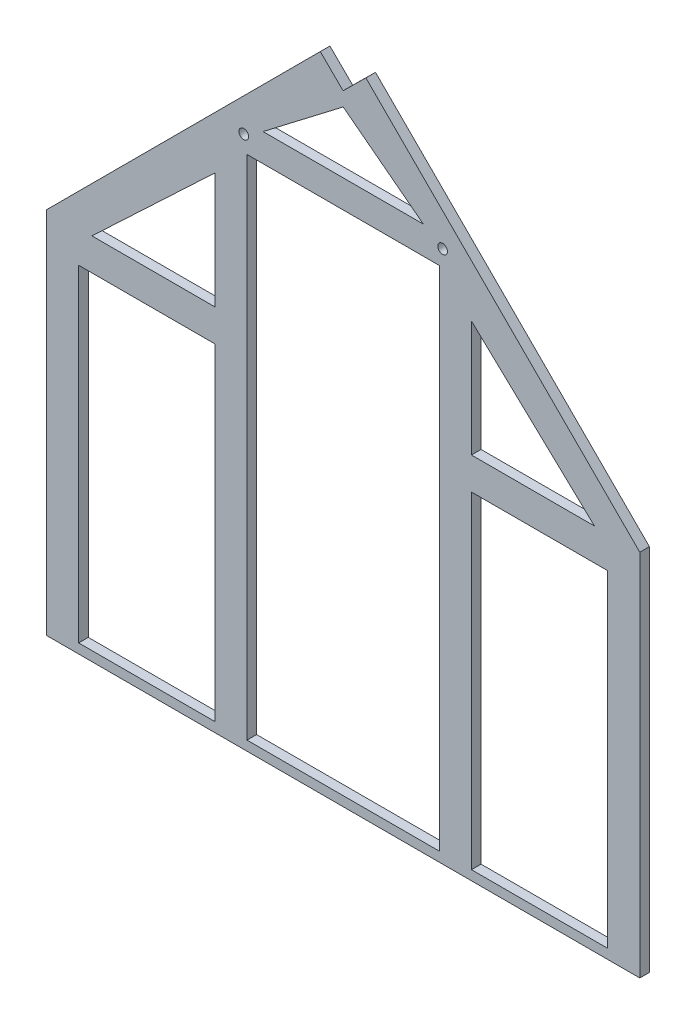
ISO-10303-21;
HEADER;
FILE_DESCRIPTION(('STEP AP214'),'2;1');
FILE_NAME('part.step','',(''),(''),'','','');
FILE_SCHEMA(('AUTOMOTIVE_DESIGN { 1 0 10303 214 1 1 1 1 }'));
ENDSEC;
DATA;
#1=APPLICATION_CONTEXT('core data for automotive mechanical design processes');
#2=APPLICATION_PROTOCOL_DEFINITION('international standard','automotive_design',2000,#1);
#3=PRODUCT_CONTEXT('',#1,'mechanical');
#4=PRODUCT('Part','Part','',(#3));
#5=PRODUCT_RELATED_PRODUCT_CATEGORY('part','',(#4));
#6=PRODUCT_DEFINITION_FORMATION('','',#4);
#7=PRODUCT_DEFINITION_CONTEXT('part definition',#1,'design');
#8=PRODUCT_DEFINITION('design','',#6,#7);
#9=PRODUCT_DEFINITION_SHAPE('','',#8);
#10=(LENGTH_UNIT() NAMED_UNIT(*) SI_UNIT(.MILLI.,.METRE.));
#11=(NAMED_UNIT(*) PLANE_ANGLE_UNIT() SI_UNIT($,.RADIAN.));
#12=(NAMED_UNIT(*) SI_UNIT($,.STERADIAN.) SOLID_ANGLE_UNIT());
#13=UNCERTAINTY_MEASURE_WITH_UNIT(LENGTH_MEASURE(1.E-05),#10,'distance_accuracy_value','');
#14=(GEOMETRIC_REPRESENTATION_CONTEXT(3) GLOBAL_UNCERTAINTY_ASSIGNED_CONTEXT((#13)) GLOBAL_UNIT_ASSIGNED_CONTEXT((#10,
#11,#12)) REPRESENTATION_CONTEXT('',''));
#15=CARTESIAN_POINT('',(0.,0.,0.));
#16=DIRECTION('',(0.,0.,1.));
#17=DIRECTION('',(1.,0.,0.));
#18=AXIS2_PLACEMENT_3D('',#15,#16,#17);
#19=CARTESIAN_POINT('',(0.,0.,3.));
#20=DIRECTION('',(0.,0.,-1.));
#21=DIRECTION('',(-1.,0.,0.));
#22=AXIS2_PLACEMENT_3D('',#19,#20,#21);
#23=PLANE('',#22);
#24=CARTESIAN_POINT('',(61.5,166.178932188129,3.));
#25=DIRECTION('',(0.,0.,1.));
#26=DIRECTION('',(1.,0.,0.));
#27=AXIS2_PLACEMENT_3D('',#24,#25,#26);
#28=CIRCLE('',#27,1.5);
#29=CARTESIAN_POINT('',(63.,166.178932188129,3.));
#30=VERTEX_POINT('',#29);
#31=EDGE_CURVE('E228',#30,#30,#28,.T.);
#32=ORIENTED_EDGE('',*,*,#31,.F.);
#33=EDGE_LOOP('',(#32));
#34=FACE_BOUND('',#33,.T.);
#35=DIRECTION('',(-1.,0.,0.));
#36=VECTOR('',#35,1.);
#37=CARTESIAN_POINT('',(175.,105.,3.));
#38=LINE('',#37,#36);
#39=CARTESIAN_POINT('',(175.,105.,3.));
#40=VERTEX_POINT('',#39);
#41=CARTESIAN_POINT('',(132.5,105.,3.));
#42=VERTEX_POINT('',#41);
#43=EDGE_CURVE('E255',#40,#42,#38,.T.);
#44=ORIENTED_EDGE('',*,*,#43,.F.);
#45=DIRECTION('',(0.,1.,0.));
#46=VECTOR('',#45,1.);
#47=CARTESIAN_POINT('',(175.,105.,3.));
#48=LINE('',#47,#46);
#49=CARTESIAN_POINT('',(175.,3.,3.));
#50=VERTEX_POINT('',#49);
#51=EDGE_CURVE('E262',#50,#40,#48,.T.);
#52=ORIENTED_EDGE('',*,*,#51,.F.);
#53=DIRECTION('',(1.,0.,0.));
#54=VECTOR('',#53,1.);
#55=CARTESIAN_POINT('',(175.,3.,3.));
#56=LINE('',#55,#54);
#57=CARTESIAN_POINT('',(132.5,2.99999999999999,3.));
#58=VERTEX_POINT('',#57);
#59=EDGE_CURVE('E259',#58,#50,#56,.T.);
#60=ORIENTED_EDGE('',*,*,#59,.F.);
#61=DIRECTION('',(0.,-1.,0.));
#62=VECTOR('',#61,1.);
#63=CARTESIAN_POINT('',(132.5,105.,3.));
#64=LINE('',#63,#62);
#65=EDGE_CURVE('E257',#42,#58,#64,.T.);
#66=ORIENTED_EDGE('',*,*,#65,.F.);
#67=EDGE_LOOP('',(#44,#52,#60,#66));
#68=FACE_BOUND('',#67,.T.);
#69=DIRECTION('',(-1.,0.,0.));
#70=VECTOR('',#69,1.);
#71=CARTESIAN_POINT('',(10.,105.,3.));
#72=LINE('',#71,#70);
#73=CARTESIAN_POINT('',(52.5,105.,3.));
#74=VERTEX_POINT('',#73);
#75=CARTESIAN_POINT('',(10.,105.,3.));
#76=VERTEX_POINT('',#75);
#77=EDGE_CURVE('E310',#74,#76,#72,.T.);
#78=ORIENTED_EDGE('',*,*,#77,.F.);
#79=DIRECTION('',(0.,1.,0.));
#80=VECTOR('',#79,1.);
#81=CARTESIAN_POINT('',(52.5,105.,3.));
#82=LINE('',#81,#80);
#83=CARTESIAN_POINT('',(52.5,2.99999999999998,3.));
#84=VERTEX_POINT('',#83);
#85=EDGE_CURVE('E317',#84,#74,#82,.T.);
#86=ORIENTED_EDGE('',*,*,#85,.F.);
#87=DIRECTION('',(1.,0.,0.));
#88=VECTOR('',#87,1.);
#89=CARTESIAN_POINT('',(10.,3.,3.));
#90=LINE('',#89,#88);
#91=CARTESIAN_POINT('',(10.,3.,3.));
#92=VERTEX_POINT('',#91);
#93=EDGE_CURVE('E314',#92,#84,#90,.T.);
#94=ORIENTED_EDGE('',*,*,#93,.F.);
#95=DIRECTION('',(0.,-1.,0.));
#96=VECTOR('',#95,1.);
#97=CARTESIAN_POINT('',(10.,105.,3.));
#98=LINE('',#97,#96);
#99=EDGE_CURVE('E312',#76,#92,#98,.T.);
#100=ORIENTED_EDGE('',*,*,#99,.F.);
#101=EDGE_LOOP('',(#78,#86,#94,#100));
#102=FACE_BOUND('',#101,.T.);
#103=DIRECTION('',(0.,-1.,0.));
#104=VECTOR('',#103,1.);
#105=CARTESIAN_POINT('',(62.5,2.99999999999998,3.));
#106=LINE('',#105,#104);
#107=CARTESIAN_POINT('',(62.5,161.178932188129,3.));
#108=VERTEX_POINT('',#107);
#109=CARTESIAN_POINT('',(62.5,2.99999999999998,3.));
#110=VERTEX_POINT('',#109);
#111=EDGE_CURVE('E365',#108,#110,#106,.T.);
#112=ORIENTED_EDGE('',*,*,#111,.F.);
#113=DIRECTION('',(-1.,0.,0.));
#114=VECTOR('',#113,1.);
#115=CARTESIAN_POINT('',(62.5,161.178932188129,3.));
#116=LINE('',#115,#114);
#117=CARTESIAN_POINT('',(122.5,161.178932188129,3.));
#118=VERTEX_POINT('',#117);
#119=EDGE_CURVE('E372',#118,#108,#116,.T.);
#120=ORIENTED_EDGE('',*,*,#119,.F.);
#121=DIRECTION('',(0.,1.,0.));
#122=VECTOR('',#121,1.);
#123=CARTESIAN_POINT('',(122.5,2.99999999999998,3.));
#124=LINE('',#123,#122);
#125=CARTESIAN_POINT('',(122.5,2.99999999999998,3.));
#126=VERTEX_POINT('',#125);
#127=EDGE_CURVE('E369',#126,#118,#124,.T.);
#128=ORIENTED_EDGE('',*,*,#127,.F.);
#129=DIRECTION('',(1.,0.,0.));
#130=VECTOR('',#129,1.);
#131=CARTESIAN_POINT('',(62.5,2.99999999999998,3.));
#132=LINE('',#131,#130);
#133=EDGE_CURVE('E367',#110,#126,#132,.T.);
#134=ORIENTED_EDGE('',*,*,#133,.F.);
#135=EDGE_LOOP('',(#112,#120,#128,#134));
#136=FACE_BOUND('',#135,.T.);
#137=DIRECTION('',(1.,0.,0.));
#138=VECTOR('',#137,1.);
#139=CARTESIAN_POINT('',(185.,0.,3.));
#140=LINE('',#139,#138);
#141=CARTESIAN_POINT('',(0.,0.,3.));
#142=VERTEX_POINT('',#141);
#143=CARTESIAN_POINT('',(185.,0.,3.));
#144=VERTEX_POINT('',#143);
#145=EDGE_CURVE('E399',#142,#144,#140,.T.);
#146=ORIENTED_EDGE('',*,*,#145,.T.);
#147=DIRECTION('',(0.,1.,0.));
#148=VECTOR('',#147,1.);
#149=CARTESIAN_POINT('',(185.,115.,3.));
#150=LINE('',#149,#148);
#151=CARTESIAN_POINT('',(185.,115.,3.));
#152=VERTEX_POINT('',#151);
#153=EDGE_CURVE('E402',#144,#152,#150,.T.);
#154=ORIENTED_EDGE('',*,*,#153,.T.);
#155=DIRECTION('',(-0.707247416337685,0.706966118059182,0.));
#156=VECTOR('',#155,1.);
#157=CARTESIAN_POINT('',(99.5710678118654,200.394953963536,3.));
#158=LINE('',#157,#156);
#159=CARTESIAN_POINT('',(99.5710678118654,200.394953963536,3.));
#160=VERTEX_POINT('',#159);
#161=EDGE_CURVE('E404',#152,#160,#158,.T.);
#162=ORIENTED_EDGE('',*,*,#161,.T.);
#163=DIRECTION('',(-0.710503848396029,-0.703693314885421,0.));
#164=VECTOR('',#163,1.);
#165=CARTESIAN_POINT('',(99.5710678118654,200.394953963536,3.));
#166=LINE('',#165,#164);
#167=CARTESIAN_POINT('',(92.465945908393,193.357938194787,3.));
#168=VERTEX_POINT('',#167);
#169=EDGE_CURVE('E406',#160,#168,#166,.T.);
#170=ORIENTED_EDGE('',*,*,#169,.T.);
#171=DIRECTION('',(-0.710495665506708,0.703701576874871,0.));
#172=VECTOR('',#171,1.);
#173=CARTESIAN_POINT('',(85.3609892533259,200.394953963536,3.));
#174=LINE('',#173,#172);
#175=CARTESIAN_POINT('',(85.3609892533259,200.394953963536,3.));
#176=VERTEX_POINT('',#175);
#177=EDGE_CURVE('E408',#168,#176,#174,.T.);
#178=ORIENTED_EDGE('',*,*,#177,.T.);
#179=DIRECTION('',(-0.706966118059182,-0.707247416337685,0.));
#180=VECTOR('',#179,1.);
#181=CARTESIAN_POINT('',(0.,115.,3.));
#182=LINE('',#181,#180);
#183=CARTESIAN_POINT('',(0.,115.,3.));
#184=VERTEX_POINT('',#183);
#185=EDGE_CURVE('E410',#176,#184,#182,.T.);
#186=ORIENTED_EDGE('',*,*,#185,.T.);
#187=DIRECTION('',(0.,-1.,0.));
#188=VECTOR('',#187,1.);
#189=CARTESIAN_POINT('',(0.,0.,3.));
#190=LINE('',#189,#188);
#191=EDGE_CURVE('E412',#184,#142,#190,.T.);
#192=ORIENTED_EDGE('',*,*,#191,.T.);
#193=EDGE_LOOP('',(#146,#154,#162,#170,#178,#186,#192));
#194=FACE_BOUND('',#193,.T.);
#195=DIRECTION('',(0.,1.,0.));
#196=VECTOR('',#195,1.);
#197=CARTESIAN_POINT('',(52.5000000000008,151.178932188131,3.));
#198=LINE('',#197,#196);
#199=CARTESIAN_POINT('',(52.5000000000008,115.,3.));
#200=VERTEX_POINT('',#199);
#201=CARTESIAN_POINT('',(52.5000000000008,151.178932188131,3.));
#202=VERTEX_POINT('',#201);
#203=EDGE_CURVE('E338',#200,#202,#198,.T.);
#204=ORIENTED_EDGE('',*,*,#203,.F.);
#205=DIRECTION('',(1.,0.,0.));
#206=VECTOR('',#205,1.);
#207=CARTESIAN_POINT('',(14.1421356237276,115.,3.));
#208=LINE('',#207,#206);
#209=CARTESIAN_POINT('',(14.1421356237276,115.,3.));
#210=VERTEX_POINT('',#209);
#211=EDGE_CURVE('E343',#210,#200,#208,.T.);
#212=ORIENTED_EDGE('',*,*,#211,.F.);
#213=DIRECTION('',(-0.727466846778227,-0.686142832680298,0.));
#214=VECTOR('',#213,1.);
#215=CARTESIAN_POINT('',(52.5000000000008,151.178932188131,3.));
#216=LINE('',#215,#214);
#217=EDGE_CURVE('E340',#202,#210,#216,.T.);
#218=ORIENTED_EDGE('',*,*,#217,.F.);
#219=EDGE_LOOP('',(#204,#212,#218));
#220=FACE_BOUND('',#219,.T.);
#221=DIRECTION('',(-0.727466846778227,0.686142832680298,0.));
#222=VECTOR('',#221,1.);
#223=CARTESIAN_POINT('',(132.499999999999,151.178932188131,3.));
#224=LINE('',#223,#222);
#225=CARTESIAN_POINT('',(170.857864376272,115.,3.));
#226=VERTEX_POINT('',#225);
#227=CARTESIAN_POINT('',(132.499999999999,151.178932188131,3.));
#228=VERTEX_POINT('',#227);
#229=EDGE_CURVE('E283',#226,#228,#224,.T.);
#230=ORIENTED_EDGE('',*,*,#229,.F.);
#231=DIRECTION('',(1.,0.,0.));
#232=VECTOR('',#231,1.);
#233=CARTESIAN_POINT('',(170.857864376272,115.,3.));
#234=LINE('',#233,#232);
#235=CARTESIAN_POINT('',(132.499999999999,115.,3.));
#236=VERTEX_POINT('',#235);
#237=EDGE_CURVE('E288',#236,#226,#234,.T.);
#238=ORIENTED_EDGE('',*,*,#237,.F.);
#239=DIRECTION('',(0.,-1.,0.));
#240=VECTOR('',#239,1.);
#241=CARTESIAN_POINT('',(132.499999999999,151.178932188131,3.));
#242=LINE('',#241,#240);
#243=EDGE_CURVE('E285',#228,#236,#242,.T.);
#244=ORIENTED_EDGE('',*,*,#243,.F.);
#245=EDGE_LOOP('',(#230,#238,#244));
#246=FACE_BOUND('',#245,.T.);
#247=DIRECTION('',(-0.793982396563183,0.607940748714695,0.));
#248=VECTOR('',#247,1.);
#249=CARTESIAN_POINT('',(117.5,169.857864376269,3.));
#250=LINE('',#249,#248);
#251=CARTESIAN_POINT('',(117.5,169.857864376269,3.));
#252=VERTEX_POINT('',#251);
#253=CARTESIAN_POINT('',(92.5,189.,3.));
#254=VERTEX_POINT('',#253);
#255=EDGE_CURVE('E223',#252,#254,#250,.T.);
#256=ORIENTED_EDGE('',*,*,#255,.F.);
#257=DIRECTION('',(1.,0.,0.));
#258=VECTOR('',#257,1.);
#259=CARTESIAN_POINT('',(67.5,169.857864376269,3.));
#260=LINE('',#259,#258);
#261=CARTESIAN_POINT('',(67.5,169.857864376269,3.));
#262=VERTEX_POINT('',#261);
#263=EDGE_CURVE('E239',#262,#252,#260,.T.);
#264=ORIENTED_EDGE('',*,*,#263,.F.);
#265=DIRECTION('',(-0.793982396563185,-0.607940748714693,0.));
#266=VECTOR('',#265,1.);
#267=CARTESIAN_POINT('',(92.5,189.,3.));
#268=LINE('',#267,#266);
#269=EDGE_CURVE('E237',#254,#262,#268,.T.);
#270=ORIENTED_EDGE('',*,*,#269,.F.);
#271=EDGE_LOOP('',(#256,#264,#270));
#272=FACE_BOUND('',#271,.T.);
#273=CARTESIAN_POINT('',(123.5,166.178932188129,3.));
#274=DIRECTION('',(0.,0.,1.));
#275=DIRECTION('',(-1.,0.,0.));
#276=AXIS2_PLACEMENT_3D('',#273,#274,#275);
#277=CIRCLE('',#276,1.5);
#278=CARTESIAN_POINT('',(122.,166.178932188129,3.));
#279=VERTEX_POINT('',#278);
#280=EDGE_CURVE('E575',#279,#279,#277,.T.);
#281=ORIENTED_EDGE('',*,*,#280,.F.);
#282=EDGE_LOOP('',(#281));
#283=FACE_BOUND('',#282,.T.);
#284=ADVANCED_FACE('F26',(#34,#68,#102,#136,#194,#220,#246,#272,#283),#23,.F.);
#285=CARTESIAN_POINT('',(0.,0.,0.));
#286=DIRECTION('',(0.,0.,-1.));
#287=DIRECTION('',(-1.,0.,0.));
#288=AXIS2_PLACEMENT_3D('',#285,#286,#287);
#289=PLANE('',#288);
#290=CARTESIAN_POINT('',(61.5,166.178932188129,0.));
#291=DIRECTION('',(0.,0.,1.));
#292=DIRECTION('',(1.,0.,0.));
#293=AXIS2_PLACEMENT_3D('',#290,#291,#292);
#294=CIRCLE('',#293,1.5);
#295=CARTESIAN_POINT('',(63.,166.178932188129,0.));
#296=VERTEX_POINT('',#295);
#297=EDGE_CURVE('E231',#296,#296,#294,.T.);
#298=ORIENTED_EDGE('',*,*,#297,.T.);
#299=EDGE_LOOP('',(#298));
#300=FACE_BOUND('',#299,.T.);
#301=DIRECTION('',(0.,1.,0.));
#302=VECTOR('',#301,1.);
#303=CARTESIAN_POINT('',(175.,105.,0.));
#304=LINE('',#303,#302);
#305=CARTESIAN_POINT('',(175.,3.,0.));
#306=VERTEX_POINT('',#305);
#307=CARTESIAN_POINT('',(175.,105.,0.));
#308=VERTEX_POINT('',#307);
#309=EDGE_CURVE('E252',#306,#308,#304,.T.);
#310=ORIENTED_EDGE('',*,*,#309,.T.);
#311=DIRECTION('',(-1.,0.,0.));
#312=VECTOR('',#311,1.);
#313=CARTESIAN_POINT('',(175.,105.,0.));
#314=LINE('',#313,#312);
#315=CARTESIAN_POINT('',(132.5,105.,0.));
#316=VERTEX_POINT('',#315);
#317=EDGE_CURVE('E224',#308,#316,#314,.T.);
#318=ORIENTED_EDGE('',*,*,#317,.T.);
#319=DIRECTION('',(0.,-1.,0.));
#320=VECTOR('',#319,1.);
#321=CARTESIAN_POINT('',(132.5,105.,0.));
#322=LINE('',#321,#320);
#323=CARTESIAN_POINT('',(132.5,2.99999999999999,0.));
#324=VERTEX_POINT('',#323);
#325=EDGE_CURVE('E246',#316,#324,#322,.T.);
#326=ORIENTED_EDGE('',*,*,#325,.T.);
#327=DIRECTION('',(1.,0.,0.));
#328=VECTOR('',#327,1.);
#329=CARTESIAN_POINT('',(175.,3.,0.));
#330=LINE('',#329,#328);
#331=EDGE_CURVE('E249',#324,#306,#330,.T.);
#332=ORIENTED_EDGE('',*,*,#331,.T.);
#333=EDGE_LOOP('',(#310,#318,#326,#332));
#334=FACE_BOUND('',#333,.T.);
#335=DIRECTION('',(0.,1.,0.));
#336=VECTOR('',#335,1.);
#337=CARTESIAN_POINT('',(52.5,105.,0.));
#338=LINE('',#337,#336);
#339=CARTESIAN_POINT('',(52.5,2.99999999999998,0.));
#340=VERTEX_POINT('',#339);
#341=CARTESIAN_POINT('',(52.5,105.,0.));
#342=VERTEX_POINT('',#341);
#343=EDGE_CURVE('E307',#340,#342,#338,.T.);
#344=ORIENTED_EDGE('',*,*,#343,.T.);
#345=DIRECTION('',(-1.,0.,0.));
#346=VECTOR('',#345,1.);
#347=CARTESIAN_POINT('',(10.,105.,0.));
#348=LINE('',#347,#346);
#349=CARTESIAN_POINT('',(10.,105.,0.));
#350=VERTEX_POINT('',#349);
#351=EDGE_CURVE('E298',#342,#350,#348,.T.);
#352=ORIENTED_EDGE('',*,*,#351,.T.);
#353=DIRECTION('',(0.,-1.,0.));
#354=VECTOR('',#353,1.);
#355=CARTESIAN_POINT('',(10.,105.,0.));
#356=LINE('',#355,#354);
#357=CARTESIAN_POINT('',(10.,3.,0.));
#358=VERTEX_POINT('',#357);
#359=EDGE_CURVE('E301',#350,#358,#356,.T.);
#360=ORIENTED_EDGE('',*,*,#359,.T.);
#361=DIRECTION('',(1.,0.,0.));
#362=VECTOR('',#361,1.);
#363=CARTESIAN_POINT('',(10.,3.,0.));
#364=LINE('',#363,#362);
#365=EDGE_CURVE('E304',#358,#340,#364,.T.);
#366=ORIENTED_EDGE('',*,*,#365,.T.);
#367=EDGE_LOOP('',(#344,#352,#360,#366));
#368=FACE_BOUND('',#367,.T.);
#369=DIRECTION('',(-1.,0.,0.));
#370=VECTOR('',#369,1.);
#371=CARTESIAN_POINT('',(62.5,161.178932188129,0.));
#372=LINE('',#371,#370);
#373=CARTESIAN_POINT('',(122.5,161.178932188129,0.));
#374=VERTEX_POINT('',#373);
#375=CARTESIAN_POINT('',(62.5,161.178932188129,0.));
#376=VERTEX_POINT('',#375);
#377=EDGE_CURVE('E362',#374,#376,#372,.T.);
#378=ORIENTED_EDGE('',*,*,#377,.T.);
#379=DIRECTION('',(0.,-1.,0.));
#380=VECTOR('',#379,1.);
#381=CARTESIAN_POINT('',(62.5,2.99999999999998,0.));
#382=LINE('',#381,#380);
#383=CARTESIAN_POINT('',(62.5,2.99999999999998,0.));
#384=VERTEX_POINT('',#383);
#385=EDGE_CURVE('E353',#376,#384,#382,.T.);
#386=ORIENTED_EDGE('',*,*,#385,.T.);
#387=DIRECTION('',(1.,0.,0.));
#388=VECTOR('',#387,1.);
#389=CARTESIAN_POINT('',(62.5,2.99999999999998,0.));
#390=LINE('',#389,#388);
#391=CARTESIAN_POINT('',(122.5,2.99999999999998,0.));
#392=VERTEX_POINT('',#391);
#393=EDGE_CURVE('E356',#384,#392,#390,.T.);
#394=ORIENTED_EDGE('',*,*,#393,.T.);
#395=DIRECTION('',(0.,1.,0.));
#396=VECTOR('',#395,1.);
#397=CARTESIAN_POINT('',(122.5,2.99999999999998,0.));
#398=LINE('',#397,#396);
#399=EDGE_CURVE('E359',#392,#374,#398,.T.);
#400=ORIENTED_EDGE('',*,*,#399,.T.);
#401=EDGE_LOOP('',(#378,#386,#394,#400));
#402=FACE_BOUND('',#401,.T.);
#403=DIRECTION('',(1.,0.,0.));
#404=VECTOR('',#403,1.);
#405=CARTESIAN_POINT('',(185.,0.,0.));
#406=LINE('',#405,#404);
#407=CARTESIAN_POINT('',(0.,0.,0.));
#408=VERTEX_POINT('',#407);
#409=CARTESIAN_POINT('',(185.,0.,0.));
#410=VERTEX_POINT('',#409);
#411=EDGE_CURVE('E384',#408,#410,#406,.T.);
#412=ORIENTED_EDGE('',*,*,#411,.F.);
#413=DIRECTION('',(0.,-1.,0.));
#414=VECTOR('',#413,1.);
#415=CARTESIAN_POINT('',(0.,0.,0.));
#416=LINE('',#415,#414);
#417=CARTESIAN_POINT('',(0.,115.,0.));
#418=VERTEX_POINT('',#417);
#419=EDGE_CURVE('E397',#418,#408,#416,.T.);
#420=ORIENTED_EDGE('',*,*,#419,.F.);
#421=DIRECTION('',(-0.706966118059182,-0.707247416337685,0.));
#422=VECTOR('',#421,1.);
#423=CARTESIAN_POINT('',(0.,115.,0.));
#424=LINE('',#423,#422);
#425=CARTESIAN_POINT('',(85.3609892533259,200.394953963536,0.));
#426=VERTEX_POINT('',#425);
#427=EDGE_CURVE('E395',#426,#418,#424,.T.);
#428=ORIENTED_EDGE('',*,*,#427,.F.);
#429=DIRECTION('',(-0.710495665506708,0.703701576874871,0.));
#430=VECTOR('',#429,1.);
#431=CARTESIAN_POINT('',(85.3609892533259,200.394953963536,0.));
#432=LINE('',#431,#430);
#433=CARTESIAN_POINT('',(92.465945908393,193.357938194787,0.));
#434=VERTEX_POINT('',#433);
#435=EDGE_CURVE('E393',#434,#426,#432,.T.);
#436=ORIENTED_EDGE('',*,*,#435,.F.);
#437=DIRECTION('',(-0.710503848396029,-0.703693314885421,0.));
#438=VECTOR('',#437,1.);
#439=CARTESIAN_POINT('',(99.5710678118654,200.394953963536,0.));
#440=LINE('',#439,#438);
#441=CARTESIAN_POINT('',(99.5710678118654,200.394953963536,0.));
#442=VERTEX_POINT('',#441);
#443=EDGE_CURVE('E391',#442,#434,#440,.T.);
#444=ORIENTED_EDGE('',*,*,#443,.F.);
#445=DIRECTION('',(-0.707247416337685,0.706966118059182,0.));
#446=VECTOR('',#445,1.);
#447=CARTESIAN_POINT('',(99.5710678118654,200.394953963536,0.));
#448=LINE('',#447,#446);
#449=CARTESIAN_POINT('',(185.,115.,0.));
#450=VERTEX_POINT('',#449);
#451=EDGE_CURVE('E389',#450,#442,#448,.T.);
#452=ORIENTED_EDGE('',*,*,#451,.F.);
#453=DIRECTION('',(0.,1.,0.));
#454=VECTOR('',#453,1.);
#455=CARTESIAN_POINT('',(185.,115.,0.));
#456=LINE('',#455,#454);
#457=EDGE_CURVE('E387',#410,#450,#456,.T.);
#458=ORIENTED_EDGE('',*,*,#457,.F.);
#459=EDGE_LOOP('',(#412,#420,#428,#436,#444,#452,#458));
#460=FACE_BOUND('',#459,.T.);
#461=DIRECTION('',(1.,0.,0.));
#462=VECTOR('',#461,1.);
#463=CARTESIAN_POINT('',(14.1421356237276,115.,0.));
#464=LINE('',#463,#462);
#465=CARTESIAN_POINT('',(14.1421356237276,115.,0.));
#466=VERTEX_POINT('',#465);
#467=CARTESIAN_POINT('',(52.5000000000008,115.,0.));
#468=VERTEX_POINT('',#467);
#469=EDGE_CURVE('E335',#466,#468,#464,.T.);
#470=ORIENTED_EDGE('',*,*,#469,.T.);
#471=DIRECTION('',(0.,1.,0.));
#472=VECTOR('',#471,1.);
#473=CARTESIAN_POINT('',(52.5000000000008,151.178932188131,0.));
#474=LINE('',#473,#472);
#475=CARTESIAN_POINT('',(52.5000000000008,151.178932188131,0.));
#476=VERTEX_POINT('',#475);
#477=EDGE_CURVE('E329',#468,#476,#474,.T.);
#478=ORIENTED_EDGE('',*,*,#477,.T.);
#479=DIRECTION('',(-0.727466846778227,-0.686142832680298,0.));
#480=VECTOR('',#479,1.);
#481=CARTESIAN_POINT('',(52.5000000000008,151.178932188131,0.));
#482=LINE('',#481,#480);
#483=EDGE_CURVE('E332',#476,#466,#482,.T.);
#484=ORIENTED_EDGE('',*,*,#483,.T.);
#485=EDGE_LOOP('',(#470,#478,#484));
#486=FACE_BOUND('',#485,.T.);
#487=DIRECTION('',(1.,0.,0.));
#488=VECTOR('',#487,1.);
#489=CARTESIAN_POINT('',(170.857864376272,115.,0.));
#490=LINE('',#489,#488);
#491=CARTESIAN_POINT('',(132.499999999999,115.,0.));
#492=VERTEX_POINT('',#491);
#493=CARTESIAN_POINT('',(170.857864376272,115.,0.));
#494=VERTEX_POINT('',#493);
#495=EDGE_CURVE('E280',#492,#494,#490,.T.);
#496=ORIENTED_EDGE('',*,*,#495,.T.);
#497=DIRECTION('',(-0.727466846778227,0.686142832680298,0.));
#498=VECTOR('',#497,1.);
#499=CARTESIAN_POINT('',(132.499999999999,151.178932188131,0.));
#500=LINE('',#499,#498);
#501=CARTESIAN_POINT('',(132.499999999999,151.178932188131,0.));
#502=VERTEX_POINT('',#501);
#503=EDGE_CURVE('E274',#494,#502,#500,.T.);
#504=ORIENTED_EDGE('',*,*,#503,.T.);
#505=DIRECTION('',(0.,-1.,0.));
#506=VECTOR('',#505,1.);
#507=CARTESIAN_POINT('',(132.499999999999,151.178932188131,0.));
#508=LINE('',#507,#506);
#509=EDGE_CURVE('E277',#502,#492,#508,.T.);
#510=ORIENTED_EDGE('',*,*,#509,.T.);
#511=EDGE_LOOP('',(#496,#504,#510));
#512=FACE_BOUND('',#511,.T.);
#513=DIRECTION('',(1.,0.,0.));
#514=VECTOR('',#513,1.);
#515=CARTESIAN_POINT('',(67.5,169.857864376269,0.));
#516=LINE('',#515,#514);
#517=CARTESIAN_POINT('',(67.5,169.857864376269,0.));
#518=VERTEX_POINT('',#517);
#519=CARTESIAN_POINT('',(117.5,169.857864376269,0.));
#520=VERTEX_POINT('',#519);
#521=EDGE_CURVE('E219',#518,#520,#516,.T.);
#522=ORIENTED_EDGE('',*,*,#521,.T.);
#523=DIRECTION('',(-0.793982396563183,0.607940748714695,0.));
#524=VECTOR('',#523,1.);
#525=CARTESIAN_POINT('',(117.5,169.857864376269,0.));
#526=LINE('',#525,#524);
#527=CARTESIAN_POINT('',(92.5,189.,0.));
#528=VERTEX_POINT('',#527);
#529=EDGE_CURVE('E49',#520,#528,#526,.T.);
#530=ORIENTED_EDGE('',*,*,#529,.T.);
#531=DIRECTION('',(-0.793982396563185,-0.607940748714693,0.));
#532=VECTOR('',#531,1.);
#533=CARTESIAN_POINT('',(92.5,189.,0.));
#534=LINE('',#533,#532);
#535=EDGE_CURVE('E213',#528,#518,#534,.T.);
#536=ORIENTED_EDGE('',*,*,#535,.T.);
#537=EDGE_LOOP('',(#522,#530,#536));
#538=FACE_BOUND('',#537,.T.);
#539=CARTESIAN_POINT('',(123.5,166.178932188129,0.));
#540=DIRECTION('',(0.,0.,1.));
#541=DIRECTION('',(-1.,0.,0.));
#542=AXIS2_PLACEMENT_3D('',#539,#540,#541);
#543=CIRCLE('',#542,1.5);
#544=CARTESIAN_POINT('',(122.,166.178932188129,0.));
#545=VERTEX_POINT('',#544);
#546=EDGE_CURVE('E578',#545,#545,#543,.T.);
#547=ORIENTED_EDGE('',*,*,#546,.T.);
#548=EDGE_LOOP('',(#547));
#549=FACE_BOUND('',#548,.T.);
#550=ADVANCED_FACE('F226',(#300,#334,#368,#402,#460,#486,#512,#538,#549),#289,.T.);
#551=CARTESIAN_POINT('',(185.,0.,3.));
#552=DIRECTION('',(0.,1.,0.));
#553=DIRECTION('',(-1.,0.,0.));
#554=AXIS2_PLACEMENT_3D('',#551,#552,#553);
#555=PLANE('',#554);
#556=ORIENTED_EDGE('',*,*,#411,.T.);
#557=DIRECTION('',(0.,0.,-1.));
#558=VECTOR('',#557,1.);
#559=CARTESIAN_POINT('',(185.,0.,3.));
#560=LINE('',#559,#558);
#561=EDGE_CURVE('E11',#144,#410,#560,.T.);
#562=ORIENTED_EDGE('',*,*,#561,.F.);
#563=ORIENTED_EDGE('',*,*,#145,.F.);
#564=DIRECTION('',(0.,0.,-1.));
#565=VECTOR('',#564,1.);
#566=CARTESIAN_POINT('',(0.,0.,3.));
#567=LINE('',#566,#565);
#568=EDGE_CURVE('E414',#142,#408,#567,.T.);
#569=ORIENTED_EDGE('',*,*,#568,.T.);
#570=EDGE_LOOP('',(#556,#562,#563,#569));
#571=FACE_BOUND('',#570,.T.);
#572=ADVANCED_FACE('F28',(#571),#555,.F.);
#573=CARTESIAN_POINT('',(185.,115.,3.));
#574=DIRECTION('',(-1.,0.,0.));
#575=DIRECTION('',(0.,-1.,0.));
#576=AXIS2_PLACEMENT_3D('',#573,#574,#575);
#577=PLANE('',#576);
#578=ORIENTED_EDGE('',*,*,#457,.T.);
#579=DIRECTION('',(0.,0.,-1.));
#580=VECTOR('',#579,1.);
#581=CARTESIAN_POINT('',(185.,115.,3.));
#582=LINE('',#581,#580);
#583=EDGE_CURVE('E34',#152,#450,#582,.T.);
#584=ORIENTED_EDGE('',*,*,#583,.F.);
#585=ORIENTED_EDGE('',*,*,#153,.F.);
#586=ORIENTED_EDGE('',*,*,#561,.T.);
#587=EDGE_LOOP('',(#578,#584,#585,#586));
#588=FACE_BOUND('',#587,.T.);
#589=ADVANCED_FACE('F456',(#588),#577,.F.);
#590=CARTESIAN_POINT('',(99.5710678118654,200.394953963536,3.));
#591=DIRECTION('',(-0.706966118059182,-0.707247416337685,0.));
#592=DIRECTION('',(0.707247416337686,-0.706966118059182,0.));
#593=AXIS2_PLACEMENT_3D('',#590,#591,#592);
#594=PLANE('',#593);
#595=ORIENTED_EDGE('',*,*,#451,.T.);
#596=DIRECTION('',(0.,0.,-1.));
#597=VECTOR('',#596,1.);
#598=CARTESIAN_POINT('',(99.5710678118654,200.394953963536,3.));
#599=LINE('',#598,#597);
#600=EDGE_CURVE('E426',#160,#442,#599,.T.);
#601=ORIENTED_EDGE('',*,*,#600,.F.);
#602=ORIENTED_EDGE('',*,*,#161,.F.);
#603=ORIENTED_EDGE('',*,*,#583,.T.);
#604=EDGE_LOOP('',(#595,#601,#602,#603));
#605=FACE_BOUND('',#604,.T.);
#606=ADVANCED_FACE('F433',(#605),#594,.F.);
#607=CARTESIAN_POINT('',(99.5710678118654,200.394953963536,3.));
#608=DIRECTION('',(0.703693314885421,-0.71050384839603,0.));
#609=DIRECTION('',(0.71050384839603,0.703693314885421,0.));
#610=AXIS2_PLACEMENT_3D('',#607,#608,#609);
#611=PLANE('',#610);
#612=ORIENTED_EDGE('',*,*,#443,.T.);
#613=DIRECTION('',(0.,0.,-1.));
#614=VECTOR('',#613,1.);
#615=CARTESIAN_POINT('',(92.465945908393,193.357938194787,3.));
#616=LINE('',#615,#614);
#617=EDGE_CURVE('E423',#168,#434,#616,.T.);
#618=ORIENTED_EDGE('',*,*,#617,.F.);
#619=ORIENTED_EDGE('',*,*,#169,.F.);
#620=ORIENTED_EDGE('',*,*,#600,.T.);
#621=EDGE_LOOP('',(#612,#618,#619,#620));
#622=FACE_BOUND('',#621,.T.);
#623=ADVANCED_FACE('F444',(#622),#611,.F.);
#624=CARTESIAN_POINT('',(85.3609892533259,200.394953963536,3.));
#625=DIRECTION('',(-0.703701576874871,-0.710495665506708,0.));
#626=DIRECTION('',(0.710495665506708,-0.703701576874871,0.));
#627=AXIS2_PLACEMENT_3D('',#624,#625,#626);
#628=PLANE('',#627);
#629=ORIENTED_EDGE('',*,*,#435,.T.);
#630=DIRECTION('',(0.,0.,-1.));
#631=VECTOR('',#630,1.);
#632=CARTESIAN_POINT('',(85.3609892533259,200.394953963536,3.));
#633=LINE('',#632,#631);
#634=EDGE_CURVE('E420',#176,#426,#633,.T.);
#635=ORIENTED_EDGE('',*,*,#634,.F.);
#636=ORIENTED_EDGE('',*,*,#177,.F.);
#637=ORIENTED_EDGE('',*,*,#617,.T.);
#638=EDGE_LOOP('',(#629,#635,#636,#637));
#639=FACE_BOUND('',#638,.T.);
#640=ADVANCED_FACE('F448',(#639),#628,.F.);
#641=CARTESIAN_POINT('',(0.,115.,3.));
#642=DIRECTION('',(0.707247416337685,-0.706966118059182,0.));
#643=DIRECTION('',(0.706966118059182,0.707247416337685,0.));
#644=AXIS2_PLACEMENT_3D('',#641,#642,#643);
#645=PLANE('',#644);
#646=ORIENTED_EDGE('',*,*,#427,.T.);
#647=DIRECTION('',(0.,0.,-1.));
#648=VECTOR('',#647,1.);
#649=CARTESIAN_POINT('',(0.,115.,3.));
#650=LINE('',#649,#648);
#651=EDGE_CURVE('E417',#184,#418,#650,.T.);
#652=ORIENTED_EDGE('',*,*,#651,.F.);
#653=ORIENTED_EDGE('',*,*,#185,.F.);
#654=ORIENTED_EDGE('',*,*,#634,.T.);
#655=EDGE_LOOP('',(#646,#652,#653,#654));
#656=FACE_BOUND('',#655,.T.);
#657=ADVANCED_FACE('F464',(#656),#645,.F.);
#658=CARTESIAN_POINT('',(0.,0.,3.));
#659=DIRECTION('',(1.,0.,0.));
#660=DIRECTION('',(0.,0.,-1.));
#661=AXIS2_PLACEMENT_3D('',#658,#659,#660);
#662=PLANE('',#661);
#663=ORIENTED_EDGE('',*,*,#419,.T.);
#664=ORIENTED_EDGE('',*,*,#568,.F.);
#665=ORIENTED_EDGE('',*,*,#191,.F.);
#666=ORIENTED_EDGE('',*,*,#651,.T.);
#667=EDGE_LOOP('',(#663,#664,#665,#666));
#668=FACE_BOUND('',#667,.T.);
#669=ADVANCED_FACE('F461',(#668),#662,.F.);
#670=CARTESIAN_POINT('',(62.5,2.99999999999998,3.));
#671=DIRECTION('',(1.,0.,0.));
#672=DIRECTION('',(0.,0.,-1.));
#673=AXIS2_PLACEMENT_3D('',#670,#671,#672);
#674=PLANE('',#673);
#675=ORIENTED_EDGE('',*,*,#385,.F.);
#676=DIRECTION('',(0.,0.,-1.));
#677=VECTOR('',#676,1.);
#678=CARTESIAN_POINT('',(62.5,161.178932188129,3.));
#679=LINE('',#678,#677);
#680=EDGE_CURVE('E374',#108,#376,#679,.T.);
#681=ORIENTED_EDGE('',*,*,#680,.F.);
#682=ORIENTED_EDGE('',*,*,#111,.T.);
#683=DIRECTION('',(0.,0.,-1.));
#684=VECTOR('',#683,1.);
#685=CARTESIAN_POINT('',(62.5,2.99999999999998,3.));
#686=LINE('',#685,#684);
#687=EDGE_CURVE('E381',#110,#384,#686,.T.);
#688=ORIENTED_EDGE('',*,*,#687,.T.);
#689=EDGE_LOOP('',(#675,#681,#682,#688));
#690=FACE_BOUND('',#689,.T.);
#691=ADVANCED_FACE('F471',(#690),#674,.T.);
#692=CARTESIAN_POINT('',(62.5,2.99999999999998,3.));
#693=DIRECTION('',(0.,1.,0.));
#694=DIRECTION('',(-1.,0.,0.));
#695=AXIS2_PLACEMENT_3D('',#692,#693,#694);
#696=PLANE('',#695);
#697=ORIENTED_EDGE('',*,*,#393,.F.);
#698=ORIENTED_EDGE('',*,*,#687,.F.);
#699=ORIENTED_EDGE('',*,*,#133,.T.);
#700=DIRECTION('',(0.,0.,-1.));
#701=VECTOR('',#700,1.);
#702=CARTESIAN_POINT('',(122.5,2.99999999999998,3.));
#703=LINE('',#702,#701);
#704=EDGE_CURVE('E379',#126,#392,#703,.T.);
#705=ORIENTED_EDGE('',*,*,#704,.T.);
#706=EDGE_LOOP('',(#697,#698,#699,#705));
#707=FACE_BOUND('',#706,.T.);
#708=ADVANCED_FACE('F487',(#707),#696,.T.);
#709=CARTESIAN_POINT('',(122.5,2.99999999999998,3.));
#710=DIRECTION('',(-1.,0.,0.));
#711=DIRECTION('',(0.,0.,1.));
#712=AXIS2_PLACEMENT_3D('',#709,#710,#711);
#713=PLANE('',#712);
#714=ORIENTED_EDGE('',*,*,#399,.F.);
#715=ORIENTED_EDGE('',*,*,#704,.F.);
#716=ORIENTED_EDGE('',*,*,#127,.T.);
#717=DIRECTION('',(0.,0.,-1.));
#718=VECTOR('',#717,1.);
#719=CARTESIAN_POINT('',(122.5,161.178932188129,3.));
#720=LINE('',#719,#718);
#721=EDGE_CURVE('E377',#118,#374,#720,.T.);
#722=ORIENTED_EDGE('',*,*,#721,.T.);
#723=EDGE_LOOP('',(#714,#715,#716,#722));
#724=FACE_BOUND('',#723,.T.);
#725=ADVANCED_FACE('F491',(#724),#713,.T.);
#726=CARTESIAN_POINT('',(62.5,161.178932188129,3.));
#727=DIRECTION('',(0.,-1.,0.));
#728=DIRECTION('',(0.,0.,-1.));
#729=AXIS2_PLACEMENT_3D('',#726,#727,#728);
#730=PLANE('',#729);
#731=ORIENTED_EDGE('',*,*,#377,.F.);
#732=ORIENTED_EDGE('',*,*,#721,.F.);
#733=ORIENTED_EDGE('',*,*,#119,.T.);
#734=ORIENTED_EDGE('',*,*,#680,.T.);
#735=EDGE_LOOP('',(#731,#732,#733,#734));
#736=FACE_BOUND('',#735,.T.);
#737=ADVANCED_FACE('F495',(#736),#730,.T.);
#738=CARTESIAN_POINT('',(52.5000000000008,151.178932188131,3.));
#739=DIRECTION('',(-1.,0.,0.));
#740=DIRECTION('',(0.,-1.,0.));
#741=AXIS2_PLACEMENT_3D('',#738,#739,#740);
#742=PLANE('',#741);
#743=ORIENTED_EDGE('',*,*,#477,.F.);
#744=DIRECTION('',(0.,0.,-1.));
#745=VECTOR('',#744,1.);
#746=CARTESIAN_POINT('',(52.5000000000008,115.,3.));
#747=LINE('',#746,#745);
#748=EDGE_CURVE('E345',#200,#468,#747,.T.);
#749=ORIENTED_EDGE('',*,*,#748,.F.);
#750=ORIENTED_EDGE('',*,*,#203,.T.);
#751=DIRECTION('',(0.,0.,-1.));
#752=VECTOR('',#751,1.);
#753=CARTESIAN_POINT('',(52.5000000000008,151.178932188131,3.));
#754=LINE('',#753,#752);
#755=EDGE_CURVE('E350',#202,#476,#754,.T.);
#756=ORIENTED_EDGE('',*,*,#755,.T.);
#757=EDGE_LOOP('',(#743,#749,#750,#756));
#758=FACE_BOUND('',#757,.T.);
#759=ADVANCED_FACE('F499',(#758),#742,.T.);
#760=CARTESIAN_POINT('',(52.5000000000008,151.178932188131,3.));
#761=DIRECTION('',(0.686142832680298,-0.727466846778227,0.));
#762=DIRECTION('',(0.727466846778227,0.686142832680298,0.));
#763=AXIS2_PLACEMENT_3D('',#760,#761,#762);
#764=PLANE('',#763);
#765=ORIENTED_EDGE('',*,*,#483,.F.);
#766=ORIENTED_EDGE('',*,*,#755,.F.);
#767=ORIENTED_EDGE('',*,*,#217,.T.);
#768=DIRECTION('',(0.,0.,-1.));
#769=VECTOR('',#768,1.);
#770=CARTESIAN_POINT('',(14.1421356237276,115.,3.));
#771=LINE('',#770,#769);
#772=EDGE_CURVE('E348',#210,#466,#771,.T.);
#773=ORIENTED_EDGE('',*,*,#772,.T.);
#774=EDGE_LOOP('',(#765,#766,#767,#773));
#775=FACE_BOUND('',#774,.T.);
#776=ADVANCED_FACE('F503',(#775),#764,.T.);
#777=CARTESIAN_POINT('',(14.1421356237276,115.,3.));
#778=DIRECTION('',(0.,1.,0.));
#779=DIRECTION('',(0.,0.,1.));
#780=AXIS2_PLACEMENT_3D('',#777,#778,#779);
#781=PLANE('',#780);
#782=ORIENTED_EDGE('',*,*,#469,.F.);
#783=ORIENTED_EDGE('',*,*,#772,.F.);
#784=ORIENTED_EDGE('',*,*,#211,.T.);
#785=ORIENTED_EDGE('',*,*,#748,.T.);
#786=EDGE_LOOP('',(#782,#783,#784,#785));
#787=FACE_BOUND('',#786,.T.);
#788=ADVANCED_FACE('F507',(#787),#781,.T.);
#789=CARTESIAN_POINT('',(10.,105.,3.));
#790=DIRECTION('',(0.,-1.,0.));
#791=DIRECTION('',(0.,0.,-1.));
#792=AXIS2_PLACEMENT_3D('',#789,#790,#791);
#793=PLANE('',#792);
#794=ORIENTED_EDGE('',*,*,#351,.F.);
#795=DIRECTION('',(0.,0.,-1.));
#796=VECTOR('',#795,1.);
#797=CARTESIAN_POINT('',(52.5,105.,3.));
#798=LINE('',#797,#796);
#799=EDGE_CURVE('E319',#74,#342,#798,.T.);
#800=ORIENTED_EDGE('',*,*,#799,.F.);
#801=ORIENTED_EDGE('',*,*,#77,.T.);
#802=DIRECTION('',(0.,0.,-1.));
#803=VECTOR('',#802,1.);
#804=CARTESIAN_POINT('',(10.,105.,3.));
#805=LINE('',#804,#803);
#806=EDGE_CURVE('E326',#76,#350,#805,.T.);
#807=ORIENTED_EDGE('',*,*,#806,.T.);
#808=EDGE_LOOP('',(#794,#800,#801,#807));
#809=FACE_BOUND('',#808,.T.);
#810=ADVANCED_FACE('F511',(#809),#793,.T.);
#811=CARTESIAN_POINT('',(10.,105.,3.));
#812=DIRECTION('',(1.,0.,0.));
#813=DIRECTION('',(0.,1.,0.));
#814=AXIS2_PLACEMENT_3D('',#811,#812,#813);
#815=PLANE('',#814);
#816=ORIENTED_EDGE('',*,*,#359,.F.);
#817=ORIENTED_EDGE('',*,*,#806,.F.);
#818=ORIENTED_EDGE('',*,*,#99,.T.);
#819=DIRECTION('',(0.,0.,-1.));
#820=VECTOR('',#819,1.);
#821=CARTESIAN_POINT('',(10.,3.,3.));
#822=LINE('',#821,#820);
#823=EDGE_CURVE('E324',#92,#358,#822,.T.);
#824=ORIENTED_EDGE('',*,*,#823,.T.);
#825=EDGE_LOOP('',(#816,#817,#818,#824));
#826=FACE_BOUND('',#825,.T.);
#827=ADVANCED_FACE('F515',(#826),#815,.T.);
#828=CARTESIAN_POINT('',(10.,3.,3.));
#829=DIRECTION('',(0.,1.,0.));
#830=DIRECTION('',(-1.,0.,0.));
#831=AXIS2_PLACEMENT_3D('',#828,#829,#830);
#832=PLANE('',#831);
#833=ORIENTED_EDGE('',*,*,#365,.F.);
#834=ORIENTED_EDGE('',*,*,#823,.F.);
#835=ORIENTED_EDGE('',*,*,#93,.T.);
#836=DIRECTION('',(0.,0.,-1.));
#837=VECTOR('',#836,1.);
#838=CARTESIAN_POINT('',(52.5,2.99999999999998,3.));
#839=LINE('',#838,#837);
#840=EDGE_CURVE('E322',#84,#340,#839,.T.);
#841=ORIENTED_EDGE('',*,*,#840,.T.);
#842=EDGE_LOOP('',(#833,#834,#835,#841));
#843=FACE_BOUND('',#842,.T.);
#844=ADVANCED_FACE('F519',(#843),#832,.T.);
#845=CARTESIAN_POINT('',(52.5,105.,3.));
#846=DIRECTION('',(-1.,0.,0.));
#847=DIRECTION('',(0.,-1.,0.));
#848=AXIS2_PLACEMENT_3D('',#845,#846,#847);
#849=PLANE('',#848);
#850=ORIENTED_EDGE('',*,*,#343,.F.);
#851=ORIENTED_EDGE('',*,*,#840,.F.);
#852=ORIENTED_EDGE('',*,*,#85,.T.);
#853=ORIENTED_EDGE('',*,*,#799,.T.);
#854=EDGE_LOOP('',(#850,#851,#852,#853));
#855=FACE_BOUND('',#854,.T.);
#856=ADVANCED_FACE('F523',(#855),#849,.T.);
#857=CARTESIAN_POINT('',(132.499999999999,151.178932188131,3.));
#858=DIRECTION('',(-0.686142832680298,-0.727466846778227,0.));
#859=DIRECTION('',(0.727466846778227,-0.686142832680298,0.));
#860=AXIS2_PLACEMENT_3D('',#857,#858,#859);
#861=PLANE('',#860);
#862=ORIENTED_EDGE('',*,*,#503,.F.);
#863=DIRECTION('',(0.,0.,-1.));
#864=VECTOR('',#863,1.);
#865=CARTESIAN_POINT('',(170.857864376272,115.,3.));
#866=LINE('',#865,#864);
#867=EDGE_CURVE('E290',#226,#494,#866,.T.);
#868=ORIENTED_EDGE('',*,*,#867,.F.);
#869=ORIENTED_EDGE('',*,*,#229,.T.);
#870=DIRECTION('',(0.,0.,-1.));
#871=VECTOR('',#870,1.);
#872=CARTESIAN_POINT('',(132.499999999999,151.178932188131,3.));
#873=LINE('',#872,#871);
#874=EDGE_CURVE('E295',#228,#502,#873,.T.);
#875=ORIENTED_EDGE('',*,*,#874,.T.);
#876=EDGE_LOOP('',(#862,#868,#869,#875));
#877=FACE_BOUND('',#876,.T.);
#878=ADVANCED_FACE('F527',(#877),#861,.T.);
#879=CARTESIAN_POINT('',(132.499999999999,151.178932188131,3.));
#880=DIRECTION('',(1.,0.,0.));
#881=DIRECTION('',(0.,0.,-1.));
#882=AXIS2_PLACEMENT_3D('',#879,#880,#881);
#883=PLANE('',#882);
#884=ORIENTED_EDGE('',*,*,#509,.F.);
#885=ORIENTED_EDGE('',*,*,#874,.F.);
#886=ORIENTED_EDGE('',*,*,#243,.T.);
#887=DIRECTION('',(0.,0.,-1.));
#888=VECTOR('',#887,1.);
#889=CARTESIAN_POINT('',(132.499999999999,115.,3.));
#890=LINE('',#889,#888);
#891=EDGE_CURVE('E293',#236,#492,#890,.T.);
#892=ORIENTED_EDGE('',*,*,#891,.T.);
#893=EDGE_LOOP('',(#884,#885,#886,#892));
#894=FACE_BOUND('',#893,.T.);
#895=ADVANCED_FACE('F531',(#894),#883,.T.);
#896=CARTESIAN_POINT('',(170.857864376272,115.,3.));
#897=DIRECTION('',(0.,1.,0.));
#898=DIRECTION('',(0.,0.,1.));
#899=AXIS2_PLACEMENT_3D('',#896,#897,#898);
#900=PLANE('',#899);
#901=ORIENTED_EDGE('',*,*,#495,.F.);
#902=ORIENTED_EDGE('',*,*,#891,.F.);
#903=ORIENTED_EDGE('',*,*,#237,.T.);
#904=ORIENTED_EDGE('',*,*,#867,.T.);
#905=EDGE_LOOP('',(#901,#902,#903,#904));
#906=FACE_BOUND('',#905,.T.);
#907=ADVANCED_FACE('F535',(#906),#900,.T.);
#908=CARTESIAN_POINT('',(175.,105.,3.));
#909=DIRECTION('',(0.,-1.,0.));
#910=DIRECTION('',(0.,0.,-1.));
#911=AXIS2_PLACEMENT_3D('',#908,#909,#910);
#912=PLANE('',#911);
#913=ORIENTED_EDGE('',*,*,#317,.F.);
#914=DIRECTION('',(0.,0.,-1.));
#915=VECTOR('',#914,1.);
#916=CARTESIAN_POINT('',(175.,105.,3.));
#917=LINE('',#916,#915);
#918=EDGE_CURVE('E264',#40,#308,#917,.T.);
#919=ORIENTED_EDGE('',*,*,#918,.F.);
#920=ORIENTED_EDGE('',*,*,#43,.T.);
#921=DIRECTION('',(0.,0.,-1.));
#922=VECTOR('',#921,1.);
#923=CARTESIAN_POINT('',(132.5,105.,3.));
#924=LINE('',#923,#922);
#925=EDGE_CURVE('E271',#42,#316,#924,.T.);
#926=ORIENTED_EDGE('',*,*,#925,.T.);
#927=EDGE_LOOP('',(#913,#919,#920,#926));
#928=FACE_BOUND('',#927,.T.);
#929=ADVANCED_FACE('F539',(#928),#912,.T.);
#930=CARTESIAN_POINT('',(132.5,105.,3.));
#931=DIRECTION('',(1.,0.,0.));
#932=DIRECTION('',(0.,1.,0.));
#933=AXIS2_PLACEMENT_3D('',#930,#931,#932);
#934=PLANE('',#933);
#935=ORIENTED_EDGE('',*,*,#325,.F.);
#936=ORIENTED_EDGE('',*,*,#925,.F.);
#937=ORIENTED_EDGE('',*,*,#65,.T.);
#938=DIRECTION('',(0.,0.,-1.));
#939=VECTOR('',#938,1.);
#940=CARTESIAN_POINT('',(132.5,2.99999999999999,3.));
#941=LINE('',#940,#939);
#942=EDGE_CURVE('E269',#58,#324,#941,.T.);
#943=ORIENTED_EDGE('',*,*,#942,.T.);
#944=EDGE_LOOP('',(#935,#936,#937,#943));
#945=FACE_BOUND('',#944,.T.);
#946=ADVANCED_FACE('F543',(#945),#934,.T.);
#947=CARTESIAN_POINT('',(175.,3.,3.));
#948=DIRECTION('',(0.,1.,0.));
#949=DIRECTION('',(-1.,0.,0.));
#950=AXIS2_PLACEMENT_3D('',#947,#948,#949);
#951=PLANE('',#950);
#952=ORIENTED_EDGE('',*,*,#331,.F.);
#953=ORIENTED_EDGE('',*,*,#942,.F.);
#954=ORIENTED_EDGE('',*,*,#59,.T.);
#955=DIRECTION('',(0.,0.,-1.));
#956=VECTOR('',#955,1.);
#957=CARTESIAN_POINT('',(175.,3.,3.));
#958=LINE('',#957,#956);
#959=EDGE_CURVE('E267',#50,#306,#958,.T.);
#960=ORIENTED_EDGE('',*,*,#959,.T.);
#961=EDGE_LOOP('',(#952,#953,#954,#960));
#962=FACE_BOUND('',#961,.T.);
#963=ADVANCED_FACE('F547',(#962),#951,.T.);
#964=CARTESIAN_POINT('',(175.,105.,3.));
#965=DIRECTION('',(-1.,0.,0.));
#966=DIRECTION('',(0.,-1.,0.));
#967=AXIS2_PLACEMENT_3D('',#964,#965,#966);
#968=PLANE('',#967);
#969=ORIENTED_EDGE('',*,*,#309,.F.);
#970=ORIENTED_EDGE('',*,*,#959,.F.);
#971=ORIENTED_EDGE('',*,*,#51,.T.);
#972=ORIENTED_EDGE('',*,*,#918,.T.);
#973=EDGE_LOOP('',(#969,#970,#971,#972));
#974=FACE_BOUND('',#973,.T.);
#975=ADVANCED_FACE('F551',(#974),#968,.T.);
#976=CARTESIAN_POINT('',(117.5,169.857864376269,3.));
#977=DIRECTION('',(-0.607940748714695,-0.793982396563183,0.));
#978=DIRECTION('',(0.793982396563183,-0.607940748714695,0.));
#979=AXIS2_PLACEMENT_3D('',#976,#977,#978);
#980=PLANE('',#979);
#981=ORIENTED_EDGE('',*,*,#529,.F.);
#982=DIRECTION('',(0.,0.,-1.));
#983=VECTOR('',#982,1.);
#984=CARTESIAN_POINT('',(117.5,169.857864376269,3.));
#985=LINE('',#984,#983);
#986=EDGE_CURVE('E241',#252,#520,#985,.T.);
#987=ORIENTED_EDGE('',*,*,#986,.F.);
#988=ORIENTED_EDGE('',*,*,#255,.T.);
#989=DIRECTION('',(0.,0.,-1.));
#990=VECTOR('',#989,1.);
#991=CARTESIAN_POINT('',(92.5,189.,3.));
#992=LINE('',#991,#990);
#993=EDGE_CURVE('E215',#254,#528,#992,.T.);
#994=ORIENTED_EDGE('',*,*,#993,.T.);
#995=EDGE_LOOP('',(#981,#987,#988,#994));
#996=FACE_BOUND('',#995,.T.);
#997=ADVANCED_FACE('F221',(#996),#980,.T.);
#998=CARTESIAN_POINT('',(92.5,189.,3.));
#999=DIRECTION('',(0.607940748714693,-0.793982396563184,0.));
#1000=DIRECTION('',(0.793982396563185,0.607940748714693,0.));
#1001=AXIS2_PLACEMENT_3D('',#998,#999,#1000);
#1002=PLANE('',#1001);
#1003=ORIENTED_EDGE('',*,*,#535,.F.);
#1004=ORIENTED_EDGE('',*,*,#993,.F.);
#1005=ORIENTED_EDGE('',*,*,#269,.T.);
#1006=DIRECTION('',(0.,0.,-1.));
#1007=VECTOR('',#1006,1.);
#1008=CARTESIAN_POINT('',(67.5,169.857864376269,3.));
#1009=LINE('',#1008,#1007);
#1010=EDGE_CURVE('E41',#262,#518,#1009,.T.);
#1011=ORIENTED_EDGE('',*,*,#1010,.T.);
#1012=EDGE_LOOP('',(#1003,#1004,#1005,#1011));
#1013=FACE_BOUND('',#1012,.T.);
#1014=ADVANCED_FACE('F214',(#1013),#1002,.T.);
#1015=CARTESIAN_POINT('',(67.5,169.857864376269,3.));
#1016=DIRECTION('',(0.,1.,0.));
#1017=DIRECTION('',(-1.,0.,0.));
#1018=AXIS2_PLACEMENT_3D('',#1015,#1016,#1017);
#1019=PLANE('',#1018);
#1020=ORIENTED_EDGE('',*,*,#521,.F.);
#1021=ORIENTED_EDGE('',*,*,#1010,.F.);
#1022=ORIENTED_EDGE('',*,*,#263,.T.);
#1023=ORIENTED_EDGE('',*,*,#986,.T.);
#1024=EDGE_LOOP('',(#1020,#1021,#1022,#1023));
#1025=FACE_BOUND('',#1024,.T.);
#1026=ADVANCED_FACE('F560',(#1025),#1019,.T.);
#1027=CARTESIAN_POINT('',(61.5,166.178932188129,3.));
#1028=DIRECTION('',(0.,0.,-1.));
#1029=DIRECTION('',(-1.,0.,0.));
#1030=AXIS2_PLACEMENT_3D('',#1027,#1028,#1029);
#1031=CYLINDRICAL_SURFACE('',#1030,1.5);
#1032=ORIENTED_EDGE('',*,*,#31,.T.);
#1033=EDGE_LOOP('',(#1032));
#1034=FACE_BOUND('',#1033,.T.);
#1035=ORIENTED_EDGE('',*,*,#297,.F.);
#1036=EDGE_LOOP('',(#1035));
#1037=FACE_BOUND('',#1036,.T.);
#1038=ADVANCED_FACE('F563',(#1034,#1037),#1031,.F.);
#1039=CARTESIAN_POINT('',(123.5,166.178932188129,3.));
#1040=DIRECTION('',(0.,0.,-1.));
#1041=DIRECTION('',(-1.,0.,0.));
#1042=AXIS2_PLACEMENT_3D('',#1039,#1040,#1041);
#1043=CYLINDRICAL_SURFACE('',#1042,1.5);
#1044=ORIENTED_EDGE('',*,*,#280,.T.);
#1045=EDGE_LOOP('',(#1044));
#1046=FACE_BOUND('',#1045,.T.);
#1047=ORIENTED_EDGE('',*,*,#546,.F.);
#1048=EDGE_LOOP('',(#1047));
#1049=FACE_BOUND('',#1048,.T.);
#1050=ADVANCED_FACE('F566',(#1046,#1049),#1043,.F.);
#1051=CLOSED_SHELL('',(#284,#550,#572,#589,#606,#623,#640,#657,#669,#691,#708,#725,#737,#759,
#776,#788,#810,#827,#844,#856,#878,#895,#907,#929,#946,#963,#975,#997,#1014,#1026,#1038,#1050));
#1052=MANIFOLD_SOLID_BREP('B2',#1051);
#1053=ADVANCED_BREP_SHAPE_REPRESENTATION('',(#18,#1052),#14);
#1054=SHAPE_DEFINITION_REPRESENTATION(#9,#1053);
ENDSEC;
END-ISO-10303-21;
